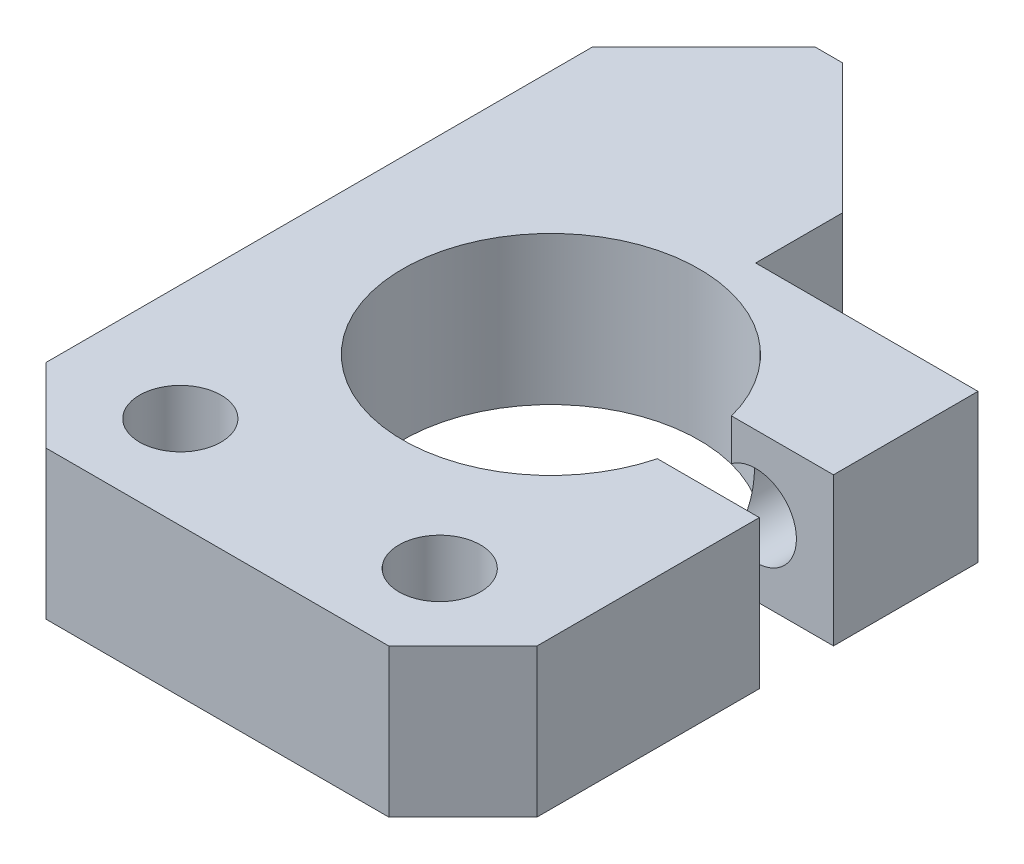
ISO-10303-21;
HEADER;
FILE_DESCRIPTION(('STEP AP214'),'2;1');
FILE_NAME('part.step','',(''),(''),'','','');
FILE_SCHEMA(('AUTOMOTIVE_DESIGN { 1 0 10303 214 1 1 1 1 }'));
ENDSEC;
DATA;
#1=APPLICATION_CONTEXT('core data for automotive mechanical design processes');
#2=APPLICATION_PROTOCOL_DEFINITION('international standard','automotive_design',2000,#1);
#3=PRODUCT_CONTEXT('',#1,'mechanical');
#4=PRODUCT('Part','Part','',(#3));
#5=PRODUCT_RELATED_PRODUCT_CATEGORY('part','',(#4));
#6=PRODUCT_DEFINITION_FORMATION('','',#4);
#7=PRODUCT_DEFINITION_CONTEXT('part definition',#1,'design');
#8=PRODUCT_DEFINITION('design','',#6,#7);
#9=PRODUCT_DEFINITION_SHAPE('','',#8);
#10=(LENGTH_UNIT() NAMED_UNIT(*) SI_UNIT(.MILLI.,.METRE.));
#11=(NAMED_UNIT(*) PLANE_ANGLE_UNIT() SI_UNIT($,.RADIAN.));
#12=(NAMED_UNIT(*) SI_UNIT($,.STERADIAN.) SOLID_ANGLE_UNIT());
#13=UNCERTAINTY_MEASURE_WITH_UNIT(LENGTH_MEASURE(1.E-05),#10,'distance_accuracy_value','');
#14=(GEOMETRIC_REPRESENTATION_CONTEXT(3) GLOBAL_UNCERTAINTY_ASSIGNED_CONTEXT((#13)) GLOBAL_UNIT_ASSIGNED_CONTEXT((#10,
#11,#12)) REPRESENTATION_CONTEXT('',''));
#15=CARTESIAN_POINT('',(0.,0.,0.));
#16=DIRECTION('',(0.,0.,1.));
#17=DIRECTION('',(1.,0.,0.));
#18=AXIS2_PLACEMENT_3D('',#15,#16,#17);
#19=CARTESIAN_POINT('',(0.,4.,0.));
#20=DIRECTION('',(0.,1.,0.));
#21=DIRECTION('',(0.,0.,1.));
#22=AXIS2_PLACEMENT_3D('',#19,#20,#21);
#23=PLANE('',#22);
#24=CARTESIAN_POINT('',(-3.5,4.,6.5));
#25=DIRECTION('',(0.,1.,0.));
#26=DIRECTION('',(0.,0.,1.));
#27=AXIS2_PLACEMENT_3D('',#24,#25,#26);
#28=CIRCLE('',#27,1.1);
#29=CARTESIAN_POINT('',(-3.5,4.,7.6));
#30=VERTEX_POINT('',#29);
#31=EDGE_CURVE('E310',#30,#30,#28,.T.);
#32=ORIENTED_EDGE('',*,*,#31,.F.);
#33=EDGE_LOOP('',(#32));
#34=FACE_BOUND('',#33,.T.);
#35=DIRECTION('',(-1.,0.,0.));
#36=VECTOR('',#35,1.);
#37=CARTESIAN_POINT('',(0.625000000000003,4.,-4.9));
#38=LINE('',#37,#36);
#39=CARTESIAN_POINT('',(6.625,4.,-4.9));
#40=VERTEX_POINT('',#39);
#41=CARTESIAN_POINT('',(0.625000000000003,4.,-4.9));
#42=VERTEX_POINT('',#41);
#43=EDGE_CURVE('E359',#40,#42,#38,.T.);
#44=ORIENTED_EDGE('',*,*,#43,.T.);
#45=DIRECTION('',(0.,0.,-1.));
#46=VECTOR('',#45,1.);
#47=CARTESIAN_POINT('',(0.625000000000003,4.,-7.25));
#48=LINE('',#47,#46);
#49=CARTESIAN_POINT('',(0.625000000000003,4.,-7.25));
#50=VERTEX_POINT('',#49);
#51=EDGE_CURVE('E299',#42,#50,#48,.T.);
#52=ORIENTED_EDGE('',*,*,#51,.T.);
#53=DIRECTION('',(-0.707106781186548,0.,-0.707106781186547));
#54=VECTOR('',#53,1.);
#55=CARTESIAN_POINT('',(-2.875,4.,-10.75));
#56=LINE('',#55,#54);
#57=CARTESIAN_POINT('',(-2.875,4.,-10.75));
#58=VERTEX_POINT('',#57);
#59=EDGE_CURVE('E395',#50,#58,#56,.T.);
#60=ORIENTED_EDGE('',*,*,#59,.T.);
#61=DIRECTION('',(-1.,0.,0.));
#62=VECTOR('',#61,1.);
#63=CARTESIAN_POINT('',(-3.625,4.,-10.75));
#64=LINE('',#63,#62);
#65=CARTESIAN_POINT('',(-3.625,4.,-10.75));
#66=VERTEX_POINT('',#65);
#67=EDGE_CURVE('E392',#58,#66,#64,.T.);
#68=ORIENTED_EDGE('',*,*,#67,.T.);
#69=DIRECTION('',(-0.707106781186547,0.,0.707106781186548));
#70=VECTOR('',#69,1.);
#71=CARTESIAN_POINT('',(-6.625,4.,-7.75));
#72=LINE('',#71,#70);
#73=CARTESIAN_POINT('',(-6.625,4.,-7.75));
#74=VERTEX_POINT('',#73);
#75=EDGE_CURVE('E389',#66,#74,#72,.T.);
#76=ORIENTED_EDGE('',*,*,#75,.T.);
#77=DIRECTION('',(0.,0.,1.));
#78=VECTOR('',#77,1.);
#79=CARTESIAN_POINT('',(-6.625,4.,7.));
#80=LINE('',#79,#78);
#81=CARTESIAN_POINT('',(-6.625,4.,7.));
#82=VERTEX_POINT('',#81);
#83=EDGE_CURVE('E386',#74,#82,#80,.T.);
#84=ORIENTED_EDGE('',*,*,#83,.T.);
#85=DIRECTION('',(0.707106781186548,0.,0.707106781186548));
#86=VECTOR('',#85,1.);
#87=CARTESIAN_POINT('',(-4.625,4.,9.));
#88=LINE('',#87,#86);
#89=CARTESIAN_POINT('',(-4.625,4.,9.));
#90=VERTEX_POINT('',#89);
#91=EDGE_CURVE('E383',#82,#90,#88,.T.);
#92=ORIENTED_EDGE('',*,*,#91,.T.);
#93=DIRECTION('',(1.,0.,0.));
#94=VECTOR('',#93,1.);
#95=CARTESIAN_POINT('',(4.625,4.,9.));
#96=LINE('',#95,#94);
#97=CARTESIAN_POINT('',(4.625,4.,9.));
#98=VERTEX_POINT('',#97);
#99=EDGE_CURVE('E380',#90,#98,#96,.T.);
#100=ORIENTED_EDGE('',*,*,#99,.T.);
#101=DIRECTION('',(0.707106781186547,0.,-0.707106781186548));
#102=VECTOR('',#101,1.);
#103=CARTESIAN_POINT('',(6.625,4.,7.));
#104=LINE('',#103,#102);
#105=CARTESIAN_POINT('',(6.625,4.,7.));
#106=VERTEX_POINT('',#105);
#107=EDGE_CURVE('E377',#98,#106,#104,.T.);
#108=ORIENTED_EDGE('',*,*,#107,.T.);
#109=DIRECTION('',(0.,0.,-1.));
#110=VECTOR('',#109,1.);
#111=CARTESIAN_POINT('',(6.625,4.,7.));
#112=LINE('',#111,#110);
#113=CARTESIAN_POINT('',(6.625,4.,0.999999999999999));
#114=VERTEX_POINT('',#113);
#115=EDGE_CURVE('E374',#106,#114,#112,.T.);
#116=ORIENTED_EDGE('',*,*,#115,.T.);
#117=DIRECTION('',(-1.,0.,0.));
#118=VECTOR('',#117,1.);
#119=CARTESIAN_POINT('',(6.625,4.,0.999999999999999));
#120=LINE('',#119,#118);
#121=CARTESIAN_POINT('',(3.87298334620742,4.,1.));
#122=VERTEX_POINT('',#121);
#123=EDGE_CURVE('E369',#114,#122,#120,.T.);
#124=ORIENTED_EDGE('',*,*,#123,.T.);
#125=CARTESIAN_POINT('',(0.,4.,0.));
#126=DIRECTION('',(0.,-1.,0.));
#127=DIRECTION('',(0.,0.,1.));
#128=AXIS2_PLACEMENT_3D('',#125,#126,#127);
#129=CIRCLE('',#128,4.);
#130=CARTESIAN_POINT('',(3.87298334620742,4.,-1.));
#131=VERTEX_POINT('',#130);
#132=EDGE_CURVE('E367',#122,#131,#129,.T.);
#133=ORIENTED_EDGE('',*,*,#132,.T.);
#134=DIRECTION('',(1.,0.,0.));
#135=VECTOR('',#134,1.);
#136=CARTESIAN_POINT('',(6.625,4.,-1.));
#137=LINE('',#136,#135);
#138=CARTESIAN_POINT('',(6.625,4.,-1.));
#139=VERTEX_POINT('',#138);
#140=EDGE_CURVE('E237',#131,#139,#137,.T.);
#141=ORIENTED_EDGE('',*,*,#140,.T.);
#142=DIRECTION('',(0.,0.,-1.));
#143=VECTOR('',#142,1.);
#144=CARTESIAN_POINT('',(6.625,4.,-4.9));
#145=LINE('',#144,#143);
#146=EDGE_CURVE('E320',#139,#40,#145,.T.);
#147=ORIENTED_EDGE('',*,*,#146,.T.);
#148=EDGE_LOOP('',(#44,#52,#60,#68,#76,#84,#92,#100,#108,#116,#124,#133,#141,#147));
#149=FACE_BOUND('',#148,.T.);
#150=CARTESIAN_POINT('',(3.5,4.,6.5));
#151=DIRECTION('',(0.,1.,0.));
#152=DIRECTION('',(0.,0.,1.));
#153=AXIS2_PLACEMENT_3D('',#150,#151,#152);
#154=CIRCLE('',#153,1.1);
#155=CARTESIAN_POINT('',(3.5,4.,7.6));
#156=VERTEX_POINT('',#155);
#157=EDGE_CURVE('E194',#156,#156,#154,.T.);
#158=ORIENTED_EDGE('',*,*,#157,.F.);
#159=EDGE_LOOP('',(#158));
#160=FACE_BOUND('',#159,.T.);
#161=ADVANCED_FACE('F48',(#34,#149,#160),#23,.T.);
#162=CARTESIAN_POINT('',(0.,0.,0.));
#163=DIRECTION('',(0.,1.,0.));
#164=DIRECTION('',(0.,0.,1.));
#165=AXIS2_PLACEMENT_3D('',#162,#163,#164);
#166=PLANE('',#165);
#167=DIRECTION('',(-1.,0.,0.));
#168=VECTOR('',#167,1.);
#169=CARTESIAN_POINT('',(0.625000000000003,0.,-4.9));
#170=LINE('',#169,#168);
#171=CARTESIAN_POINT('',(6.625,0.,-4.9));
#172=VERTEX_POINT('',#171);
#173=CARTESIAN_POINT('',(0.625000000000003,0.,-4.9));
#174=VERTEX_POINT('',#173);
#175=EDGE_CURVE('E305',#172,#174,#170,.T.);
#176=ORIENTED_EDGE('',*,*,#175,.F.);
#177=DIRECTION('',(0.,0.,-1.));
#178=VECTOR('',#177,1.);
#179=CARTESIAN_POINT('',(6.625,0.,-4.9));
#180=LINE('',#179,#178);
#181=CARTESIAN_POINT('',(6.625,0.,-1.));
#182=VERTEX_POINT('',#181);
#183=EDGE_CURVE('E357',#182,#172,#180,.T.);
#184=ORIENTED_EDGE('',*,*,#183,.F.);
#185=DIRECTION('',(1.,0.,0.));
#186=VECTOR('',#185,1.);
#187=CARTESIAN_POINT('',(6.625,0.,-1.));
#188=LINE('',#187,#186);
#189=CARTESIAN_POINT('',(3.87298334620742,0.,-1.));
#190=VERTEX_POINT('',#189);
#191=EDGE_CURVE('E354',#190,#182,#188,.T.);
#192=ORIENTED_EDGE('',*,*,#191,.F.);
#193=CARTESIAN_POINT('',(0.,0.,0.));
#194=DIRECTION('',(0.,-1.,0.));
#195=DIRECTION('',(0.,0.,1.));
#196=AXIS2_PLACEMENT_3D('',#193,#194,#195);
#197=CIRCLE('',#196,4.);
#198=CARTESIAN_POINT('',(3.87298334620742,0.,1.));
#199=VERTEX_POINT('',#198);
#200=EDGE_CURVE('E350',#199,#190,#197,.T.);
#201=ORIENTED_EDGE('',*,*,#200,.F.);
#202=DIRECTION('',(-1.,0.,0.));
#203=VECTOR('',#202,1.);
#204=CARTESIAN_POINT('',(6.625,0.,0.999999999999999));
#205=LINE('',#204,#203);
#206=CARTESIAN_POINT('',(6.625,0.,0.999999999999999));
#207=VERTEX_POINT('',#206);
#208=EDGE_CURVE('E346',#207,#199,#205,.T.);
#209=ORIENTED_EDGE('',*,*,#208,.F.);
#210=DIRECTION('',(0.,0.,-1.));
#211=VECTOR('',#210,1.);
#212=CARTESIAN_POINT('',(6.625,0.,7.));
#213=LINE('',#212,#211);
#214=CARTESIAN_POINT('',(6.625,0.,7.));
#215=VERTEX_POINT('',#214);
#216=EDGE_CURVE('E343',#215,#207,#213,.T.);
#217=ORIENTED_EDGE('',*,*,#216,.F.);
#218=DIRECTION('',(0.707106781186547,0.,-0.707106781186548));
#219=VECTOR('',#218,1.);
#220=CARTESIAN_POINT('',(6.625,0.,7.));
#221=LINE('',#220,#219);
#222=CARTESIAN_POINT('',(4.625,0.,9.));
#223=VERTEX_POINT('',#222);
#224=EDGE_CURVE('E340',#223,#215,#221,.T.);
#225=ORIENTED_EDGE('',*,*,#224,.F.);
#226=DIRECTION('',(1.,0.,0.));
#227=VECTOR('',#226,1.);
#228=CARTESIAN_POINT('',(4.625,0.,9.));
#229=LINE('',#228,#227);
#230=CARTESIAN_POINT('',(-4.625,0.,9.));
#231=VERTEX_POINT('',#230);
#232=EDGE_CURVE('E337',#231,#223,#229,.T.);
#233=ORIENTED_EDGE('',*,*,#232,.F.);
#234=DIRECTION('',(0.707106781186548,0.,0.707106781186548));
#235=VECTOR('',#234,1.);
#236=CARTESIAN_POINT('',(-4.625,0.,9.));
#237=LINE('',#236,#235);
#238=CARTESIAN_POINT('',(-6.625,0.,7.));
#239=VERTEX_POINT('',#238);
#240=EDGE_CURVE('E334',#239,#231,#237,.T.);
#241=ORIENTED_EDGE('',*,*,#240,.F.);
#242=DIRECTION('',(0.,0.,1.));
#243=VECTOR('',#242,1.);
#244=CARTESIAN_POINT('',(-6.625,0.,7.));
#245=LINE('',#244,#243);
#246=CARTESIAN_POINT('',(-6.625,0.,-7.75));
#247=VERTEX_POINT('',#246);
#248=EDGE_CURVE('E331',#247,#239,#245,.T.);
#249=ORIENTED_EDGE('',*,*,#248,.F.);
#250=DIRECTION('',(-0.707106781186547,0.,0.707106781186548));
#251=VECTOR('',#250,1.);
#252=CARTESIAN_POINT('',(-6.625,0.,-7.75));
#253=LINE('',#252,#251);
#254=CARTESIAN_POINT('',(-3.625,0.,-10.75));
#255=VERTEX_POINT('',#254);
#256=EDGE_CURVE('E328',#255,#247,#253,.T.);
#257=ORIENTED_EDGE('',*,*,#256,.F.);
#258=DIRECTION('',(-1.,0.,0.));
#259=VECTOR('',#258,1.);
#260=CARTESIAN_POINT('',(-3.625,0.,-10.75));
#261=LINE('',#260,#259);
#262=CARTESIAN_POINT('',(-2.875,0.,-10.75));
#263=VERTEX_POINT('',#262);
#264=EDGE_CURVE('E325',#263,#255,#261,.T.);
#265=ORIENTED_EDGE('',*,*,#264,.F.);
#266=DIRECTION('',(-0.707106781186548,0.,-0.707106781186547));
#267=VECTOR('',#266,1.);
#268=CARTESIAN_POINT('',(-2.875,0.,-10.75));
#269=LINE('',#268,#267);
#270=CARTESIAN_POINT('',(0.625000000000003,0.,-7.25));
#271=VERTEX_POINT('',#270);
#272=EDGE_CURVE('E314',#271,#263,#269,.T.);
#273=ORIENTED_EDGE('',*,*,#272,.F.);
#274=DIRECTION('',(0.,0.,-1.));
#275=VECTOR('',#274,1.);
#276=CARTESIAN_POINT('',(0.625000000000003,0.,-7.25));
#277=LINE('',#276,#275);
#278=EDGE_CURVE('E298',#174,#271,#277,.T.);
#279=ORIENTED_EDGE('',*,*,#278,.F.);
#280=EDGE_LOOP('',(#176,#184,#192,#201,#209,#217,#225,#233,#241,#249,#257,#265,#273,#279));
#281=FACE_BOUND('',#280,.T.);
#282=CARTESIAN_POINT('',(-3.5,0.,6.5));
#283=DIRECTION('',(0.,1.,0.));
#284=DIRECTION('',(0.,0.,1.));
#285=AXIS2_PLACEMENT_3D('',#282,#283,#284);
#286=CIRCLE('',#285,1.1);
#287=CARTESIAN_POINT('',(-3.5,0.,7.6));
#288=VERTEX_POINT('',#287);
#289=EDGE_CURVE('E317',#288,#288,#286,.T.);
#290=ORIENTED_EDGE('',*,*,#289,.T.);
#291=EDGE_LOOP('',(#290));
#292=FACE_BOUND('',#291,.T.);
#293=CARTESIAN_POINT('',(3.5,0.,6.5));
#294=DIRECTION('',(0.,1.,0.));
#295=DIRECTION('',(0.,0.,1.));
#296=AXIS2_PLACEMENT_3D('',#293,#294,#295);
#297=CIRCLE('',#296,1.1);
#298=CARTESIAN_POINT('',(3.5,0.,7.6));
#299=VERTEX_POINT('',#298);
#300=EDGE_CURVE('E193',#299,#299,#297,.T.);
#301=ORIENTED_EDGE('',*,*,#300,.T.);
#302=EDGE_LOOP('',(#301));
#303=FACE_BOUND('',#302,.T.);
#304=ADVANCED_FACE('F216',(#281,#292,#303),#166,.F.);
#305=CARTESIAN_POINT('',(0.625000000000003,4.,-4.9));
#306=DIRECTION('',(0.,0.,1.));
#307=DIRECTION('',(1.,0.,0.));
#308=AXIS2_PLACEMENT_3D('',#305,#306,#307);
#309=PLANE('',#308);
#310=CARTESIAN_POINT('',(4.525,2.,-4.9));
#311=DIRECTION('',(0.,0.,-1.));
#312=DIRECTION('',(-1.,0.,0.));
#313=AXIS2_PLACEMENT_3D('',#310,#311,#312);
#314=CIRCLE('',#313,1.1);
#315=CARTESIAN_POINT('',(3.425,2.,-4.9));
#316=VERTEX_POINT('',#315);
#317=EDGE_CURVE('E178',#316,#316,#314,.T.);
#318=ORIENTED_EDGE('',*,*,#317,.F.);
#319=EDGE_LOOP('',(#318));
#320=FACE_BOUND('',#319,.T.);
#321=ORIENTED_EDGE('',*,*,#175,.T.);
#322=DIRECTION('',(0.,-1.,0.));
#323=VECTOR('',#322,1.);
#324=CARTESIAN_POINT('',(0.625000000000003,4.,-4.9));
#325=LINE('',#324,#323);
#326=EDGE_CURVE('E289',#42,#174,#325,.T.);
#327=ORIENTED_EDGE('',*,*,#326,.F.);
#328=ORIENTED_EDGE('',*,*,#43,.F.);
#329=DIRECTION('',(0.,-1.,0.));
#330=VECTOR('',#329,1.);
#331=CARTESIAN_POINT('',(6.625,4.,-4.9));
#332=LINE('',#331,#330);
#333=EDGE_CURVE('E307',#40,#172,#332,.T.);
#334=ORIENTED_EDGE('',*,*,#333,.T.);
#335=EDGE_LOOP('',(#321,#327,#328,#334));
#336=FACE_BOUND('',#335,.T.);
#337=ADVANCED_FACE('F50',(#320,#336),#309,.F.);
#338=CARTESIAN_POINT('',(0.625000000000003,4.,-7.25));
#339=DIRECTION('',(-1.,0.,0.));
#340=DIRECTION('',(0.,0.,1.));
#341=AXIS2_PLACEMENT_3D('',#338,#339,#340);
#342=PLANE('',#341);
#343=ORIENTED_EDGE('',*,*,#278,.T.);
#344=DIRECTION('',(0.,-1.,0.));
#345=VECTOR('',#344,1.);
#346=CARTESIAN_POINT('',(0.625000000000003,4.,-7.25));
#347=LINE('',#346,#345);
#348=EDGE_CURVE('E285',#50,#271,#347,.T.);
#349=ORIENTED_EDGE('',*,*,#348,.F.);
#350=ORIENTED_EDGE('',*,*,#51,.F.);
#351=ORIENTED_EDGE('',*,*,#326,.T.);
#352=EDGE_LOOP('',(#343,#349,#350,#351));
#353=FACE_BOUND('',#352,.T.);
#354=ADVANCED_FACE('F296',(#353),#342,.F.);
#355=CARTESIAN_POINT('',(-2.875,4.,-10.75));
#356=DIRECTION('',(-0.707106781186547,0.,0.707106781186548));
#357=DIRECTION('',(0.707106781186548,0.,0.707106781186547));
#358=AXIS2_PLACEMENT_3D('',#355,#356,#357);
#359=PLANE('',#358);
#360=ORIENTED_EDGE('',*,*,#272,.T.);
#361=DIRECTION('',(0.,-1.,0.));
#362=VECTOR('',#361,1.);
#363=CARTESIAN_POINT('',(-2.875,4.,-10.75));
#364=LINE('',#363,#362);
#365=EDGE_CURVE('E281',#58,#263,#364,.T.);
#366=ORIENTED_EDGE('',*,*,#365,.F.);
#367=ORIENTED_EDGE('',*,*,#59,.F.);
#368=ORIENTED_EDGE('',*,*,#348,.T.);
#369=EDGE_LOOP('',(#360,#366,#367,#368));
#370=FACE_BOUND('',#369,.T.);
#371=ADVANCED_FACE('F420',(#370),#359,.F.);
#372=CARTESIAN_POINT('',(-3.625,4.,-10.75));
#373=DIRECTION('',(0.,0.,1.));
#374=DIRECTION('',(1.,0.,0.));
#375=AXIS2_PLACEMENT_3D('',#372,#373,#374);
#376=PLANE('',#375);
#377=ORIENTED_EDGE('',*,*,#264,.T.);
#378=DIRECTION('',(0.,-1.,0.));
#379=VECTOR('',#378,1.);
#380=CARTESIAN_POINT('',(-3.625,4.,-10.75));
#381=LINE('',#380,#379);
#382=EDGE_CURVE('E277',#66,#255,#381,.T.);
#383=ORIENTED_EDGE('',*,*,#382,.F.);
#384=ORIENTED_EDGE('',*,*,#67,.F.);
#385=ORIENTED_EDGE('',*,*,#365,.T.);
#386=EDGE_LOOP('',(#377,#383,#384,#385));
#387=FACE_BOUND('',#386,.T.);
#388=ADVANCED_FACE('F425',(#387),#376,.F.);
#389=CARTESIAN_POINT('',(-6.625,4.,-7.75));
#390=DIRECTION('',(0.707106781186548,0.,0.707106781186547));
#391=DIRECTION('',(0.707106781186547,0.,-0.707106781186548));
#392=AXIS2_PLACEMENT_3D('',#389,#390,#391);
#393=PLANE('',#392);
#394=ORIENTED_EDGE('',*,*,#256,.T.);
#395=DIRECTION('',(0.,-1.,0.));
#396=VECTOR('',#395,1.);
#397=CARTESIAN_POINT('',(-6.625,4.,-7.75));
#398=LINE('',#397,#396);
#399=EDGE_CURVE('E273',#74,#247,#398,.T.);
#400=ORIENTED_EDGE('',*,*,#399,.F.);
#401=ORIENTED_EDGE('',*,*,#75,.F.);
#402=ORIENTED_EDGE('',*,*,#382,.T.);
#403=EDGE_LOOP('',(#394,#400,#401,#402));
#404=FACE_BOUND('',#403,.T.);
#405=ADVANCED_FACE('F431',(#404),#393,.F.);
#406=CARTESIAN_POINT('',(-6.625,4.,7.));
#407=DIRECTION('',(1.,0.,0.));
#408=DIRECTION('',(0.,0.,-1.));
#409=AXIS2_PLACEMENT_3D('',#406,#407,#408);
#410=PLANE('',#409);
#411=ORIENTED_EDGE('',*,*,#248,.T.);
#412=DIRECTION('',(0.,-1.,0.));
#413=VECTOR('',#412,1.);
#414=CARTESIAN_POINT('',(-6.625,4.,7.));
#415=LINE('',#414,#413);
#416=EDGE_CURVE('E269',#82,#239,#415,.T.);
#417=ORIENTED_EDGE('',*,*,#416,.F.);
#418=ORIENTED_EDGE('',*,*,#83,.F.);
#419=ORIENTED_EDGE('',*,*,#399,.T.);
#420=EDGE_LOOP('',(#411,#417,#418,#419));
#421=FACE_BOUND('',#420,.T.);
#422=ADVANCED_FACE('F435',(#421),#410,.F.);
#423=CARTESIAN_POINT('',(-4.625,4.,9.));
#424=DIRECTION('',(0.707106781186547,0.,-0.707106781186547));
#425=DIRECTION('',(-0.707106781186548,0.,-0.707106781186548));
#426=AXIS2_PLACEMENT_3D('',#423,#424,#425);
#427=PLANE('',#426);
#428=ORIENTED_EDGE('',*,*,#240,.T.);
#429=DIRECTION('',(0.,-1.,0.));
#430=VECTOR('',#429,1.);
#431=CARTESIAN_POINT('',(-4.625,4.,9.));
#432=LINE('',#431,#430);
#433=EDGE_CURVE('E265',#90,#231,#432,.T.);
#434=ORIENTED_EDGE('',*,*,#433,.F.);
#435=ORIENTED_EDGE('',*,*,#91,.F.);
#436=ORIENTED_EDGE('',*,*,#416,.T.);
#437=EDGE_LOOP('',(#428,#434,#435,#436));
#438=FACE_BOUND('',#437,.T.);
#439=ADVANCED_FACE('F440',(#438),#427,.F.);
#440=CARTESIAN_POINT('',(4.625,4.,9.));
#441=DIRECTION('',(0.,0.,-1.));
#442=DIRECTION('',(-1.,0.,0.));
#443=AXIS2_PLACEMENT_3D('',#440,#441,#442);
#444=PLANE('',#443);
#445=ORIENTED_EDGE('',*,*,#232,.T.);
#446=DIRECTION('',(0.,-1.,0.));
#447=VECTOR('',#446,1.);
#448=CARTESIAN_POINT('',(4.625,4.,9.));
#449=LINE('',#448,#447);
#450=EDGE_CURVE('E261',#98,#223,#449,.T.);
#451=ORIENTED_EDGE('',*,*,#450,.F.);
#452=ORIENTED_EDGE('',*,*,#99,.F.);
#453=ORIENTED_EDGE('',*,*,#433,.T.);
#454=EDGE_LOOP('',(#445,#451,#452,#453));
#455=FACE_BOUND('',#454,.T.);
#456=ADVANCED_FACE('F446',(#455),#444,.F.);
#457=CARTESIAN_POINT('',(6.625,4.,7.));
#458=DIRECTION('',(-0.707106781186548,0.,-0.707106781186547));
#459=DIRECTION('',(-0.707106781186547,0.,0.707106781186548));
#460=AXIS2_PLACEMENT_3D('',#457,#458,#459);
#461=PLANE('',#460);
#462=ORIENTED_EDGE('',*,*,#224,.T.);
#463=DIRECTION('',(0.,-1.,0.));
#464=VECTOR('',#463,1.);
#465=CARTESIAN_POINT('',(6.625,4.,7.));
#466=LINE('',#465,#464);
#467=EDGE_CURVE('E257',#106,#215,#466,.T.);
#468=ORIENTED_EDGE('',*,*,#467,.F.);
#469=ORIENTED_EDGE('',*,*,#107,.F.);
#470=ORIENTED_EDGE('',*,*,#450,.T.);
#471=EDGE_LOOP('',(#462,#468,#469,#470));
#472=FACE_BOUND('',#471,.T.);
#473=ADVANCED_FACE('F450',(#472),#461,.F.);
#474=CARTESIAN_POINT('',(6.625,4.,7.));
#475=DIRECTION('',(-1.,0.,0.));
#476=DIRECTION('',(0.,0.,1.));
#477=AXIS2_PLACEMENT_3D('',#474,#475,#476);
#478=PLANE('',#477);
#479=ORIENTED_EDGE('',*,*,#216,.T.);
#480=DIRECTION('',(0.,-1.,0.));
#481=VECTOR('',#480,1.);
#482=CARTESIAN_POINT('',(6.625,4.,0.999999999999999));
#483=LINE('',#482,#481);
#484=EDGE_CURVE('E253',#114,#207,#483,.T.);
#485=ORIENTED_EDGE('',*,*,#484,.F.);
#486=ORIENTED_EDGE('',*,*,#115,.F.);
#487=ORIENTED_EDGE('',*,*,#467,.T.);
#488=EDGE_LOOP('',(#479,#485,#486,#487));
#489=FACE_BOUND('',#488,.T.);
#490=ADVANCED_FACE('F455',(#489),#478,.F.);
#491=CARTESIAN_POINT('',(6.625,4.,0.999999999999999));
#492=DIRECTION('',(0.,0.,1.));
#493=DIRECTION('',(1.,0.,0.));
#494=AXIS2_PLACEMENT_3D('',#491,#492,#493);
#495=PLANE('',#494);
#496=DIRECTION('',(0.,-1.,0.));
#497=VECTOR('',#496,1.);
#498=CARTESIAN_POINT('',(3.87298334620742,4.,1.));
#499=LINE('',#498,#497);
#500=CARTESIAN_POINT('',(3.87298334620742,1.53645465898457,1.));
#501=VERTEX_POINT('',#500);
#502=EDGE_CURVE('E240',#501,#199,#499,.T.);
#503=ORIENTED_EDGE('',*,*,#502,.F.);
#504=CARTESIAN_POINT('',(4.525,2.,0.999999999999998));
#505=DIRECTION('',(0.,0.,-1.));
#506=DIRECTION('',(-1.,0.,0.));
#507=AXIS2_PLACEMENT_3D('',#504,#505,#506);
#508=CIRCLE('',#507,0.79999999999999);
#509=CARTESIAN_POINT('',(3.87298334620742,2.46354534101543,0.999999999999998));
#510=VERTEX_POINT('',#509);
#511=EDGE_CURVE('E69',#510,#501,#508,.T.);
#512=ORIENTED_EDGE('',*,*,#511,.F.);
#513=EDGE_CURVE('E245',#122,#510,#499,.T.);
#514=ORIENTED_EDGE('',*,*,#513,.F.);
#515=ORIENTED_EDGE('',*,*,#123,.F.);
#516=ORIENTED_EDGE('',*,*,#484,.T.);
#517=ORIENTED_EDGE('',*,*,#208,.T.);
#518=EDGE_LOOP('',(#503,#512,#514,#515,#516,#517));
#519=FACE_BOUND('',#518,.T.);
#520=ADVANCED_FACE('F229',(#519),#495,.F.);
#521=CARTESIAN_POINT('',(0.,4.,0.));
#522=DIRECTION('',(0.,-1.,0.));
#523=DIRECTION('',(0.,0.,-1.));
#524=AXIS2_PLACEMENT_3D('',#521,#522,#523);
#525=CYLINDRICAL_SURFACE('',#524,4.);
#526=ORIENTED_EDGE('',*,*,#513,.T.);
#527=CARTESIAN_POINT('',(3.87298334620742,2.46354534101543,1.));
#528=CARTESIAN_POINT('',(3.86679880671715,2.45483203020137,1.0239622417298));
#529=CARTESIAN_POINT('',(3.86043528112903,2.44552496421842,1.04767992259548));
#530=CARTESIAN_POINT('',(3.84741457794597,2.42547046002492,1.0945270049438));
#531=CARTESIAN_POINT('',(3.84075636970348,2.41471764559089,1.11765380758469));
#532=CARTESIAN_POINT('',(3.8271462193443,2.39138828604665,1.16341394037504));
#533=CARTESIAN_POINT('',(3.82019122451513,2.37878419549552,1.18603250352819));
#534=CARTESIAN_POINT('',(3.80625597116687,2.35162487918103,1.23001865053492));
#535=CARTESIAN_POINT('',(3.79927577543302,2.33707299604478,1.25138828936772));
#536=CARTESIAN_POINT('',(3.78589047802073,2.30655968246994,1.29129816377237));
#537=CARTESIAN_POINT('',(3.7794751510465,2.29072412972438,1.30993001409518));
#538=CARTESIAN_POINT('',(3.7671091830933,2.25676225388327,1.34507749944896));
#539=CARTESIAN_POINT('',(3.76115710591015,2.23864350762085,1.36159978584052));
#540=CARTESIAN_POINT('',(3.7509143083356,2.20270037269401,1.38954330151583));
#541=CARTESIAN_POINT('',(3.74650789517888,2.1852186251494,1.40135706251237));
#542=CARTESIAN_POINT('',(3.73866580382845,2.1484258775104,1.42214691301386));
#543=CARTESIAN_POINT('',(3.7352288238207,2.12911737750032,1.43112680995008));
#544=CARTESIAN_POINT('',(3.73027615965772,2.09312761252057,1.44397972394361));
#545=CARTESIAN_POINT('',(3.72851077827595,2.07672201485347,1.44852302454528));
#546=CARTESIAN_POINT('',(3.7259989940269,2.04332353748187,1.45497212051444));
#547=CARTESIAN_POINT('',(3.72525182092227,2.02633111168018,1.45687990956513));
#548=CARTESIAN_POINT('',(3.72485564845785,1.99221320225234,1.45789258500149));
#549=CARTESIAN_POINT('',(3.72520893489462,1.97508751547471,1.45699163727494));
#550=CARTESIAN_POINT('',(3.72697941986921,1.94125875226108,1.45245654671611));
#551=CARTESIAN_POINT('',(3.72839713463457,1.92455588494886,1.4488210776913));
#552=CARTESIAN_POINT('',(3.73212170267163,1.89227836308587,1.43919878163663));
#553=CARTESIAN_POINT('',(3.73441284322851,1.87668924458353,1.43325347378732));
#554=CARTESIAN_POINT('',(3.73970409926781,1.84655709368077,1.41939020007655));
#555=CARTESIAN_POINT('',(3.74270442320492,1.83201437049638,1.41147165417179));
#556=CARTESIAN_POINT('',(3.75140240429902,1.79477251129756,1.38824235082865));
#557=CARTESIAN_POINT('',(3.75756843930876,1.77306779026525,1.37151398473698));
#558=CARTESIAN_POINT('',(3.77069342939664,1.73265185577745,1.33501021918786));
#559=CARTESIAN_POINT('',(3.77765505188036,1.71395125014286,1.31522448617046));
#560=CARTESIAN_POINT('',(3.7971055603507,1.66648125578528,1.25834268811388));
#561=CARTESIAN_POINT('',(3.80991233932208,1.640353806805,1.21917178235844));
#562=CARTESIAN_POINT('',(3.8351126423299,1.59411030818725,1.1374344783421));
#563=CARTESIAN_POINT('',(3.84750565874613,1.57400141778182,1.0948641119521));
#564=CARTESIAN_POINT('',(3.86400386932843,1.54928129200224,1.03430594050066));
#565=CARTESIAN_POINT('',(3.86854044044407,1.54271588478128,1.01721424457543));
#566=CARTESIAN_POINT('',(3.87298334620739,1.53645465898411,1.00000000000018));
#567=B_SPLINE_CURVE_WITH_KNOTS('',3,(#527,#528,#529,#530,#531,#532,#533,#534,#535,#536,#537,
#538,#539,#540,#541,#542,#543,#544,#545,#546,#547,#548,#549,#550,#551,#552,#553,#554,#555,#556,
#557,#558,#559,#560,#561,#562,#563,#564,#565,#566),.UNSPECIFIED.,.F.,.F.,(4,2,2,2,2,2,2,2,2,2,2,
2,2,2,2,2,2,2,2,4),(0.,0.0787253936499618,0.157752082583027,0.238103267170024,0.318318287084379,
0.394006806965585,0.469450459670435,0.5338884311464,0.598239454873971,0.64936438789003,
0.700450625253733,0.751643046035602,0.802860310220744,0.853196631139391,0.903547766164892,
0.987325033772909,1.07139191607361,1.21695715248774,1.36269486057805,1.41926142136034),.UNSPECIFIED.);
#568=EDGE_CURVE('E11',#510,#501,#567,.T.);
#569=ORIENTED_EDGE('',*,*,#568,.T.);
#570=ORIENTED_EDGE('',*,*,#502,.T.);
#571=ORIENTED_EDGE('',*,*,#200,.T.);
#572=DIRECTION('',(0.,-1.,0.));
#573=VECTOR('',#572,1.);
#574=CARTESIAN_POINT('',(3.87298334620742,4.,-1.));
#575=LINE('',#574,#573);
#576=CARTESIAN_POINT('',(3.87298334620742,1.11406869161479,-1.));
#577=VERTEX_POINT('',#576);
#578=EDGE_CURVE('E241',#577,#190,#575,.T.);
#579=ORIENTED_EDGE('',*,*,#578,.F.);
#580=CARTESIAN_POINT('',(3.87298334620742,1.11406869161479,-1.));
#581=CARTESIAN_POINT('',(3.85788298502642,1.1252324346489,-1.05854880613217));
#582=CARTESIAN_POINT('',(3.84147708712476,1.13785747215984,-1.11654081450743));
#583=CARTESIAN_POINT('',(3.80626862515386,1.16694836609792,-1.23122093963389));
#584=CARTESIAN_POINT('',(3.78745166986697,1.1834378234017,-1.2878985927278));
#585=CARTESIAN_POINT('',(3.74750416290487,1.22136901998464,-1.39993357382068));
#586=CARTESIAN_POINT('',(3.72634038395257,1.24288844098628,-1.45525335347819));
#587=CARTESIAN_POINT('',(3.68264822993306,1.29181922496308,-1.56250870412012));
#588=CARTESIAN_POINT('',(3.66012408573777,1.31921293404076,-1.61445382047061));
#589=CARTESIAN_POINT('',(3.62025560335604,1.37367811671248,-1.70160474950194));
#590=CARTESIAN_POINT('',(3.6029867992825,1.39920087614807,-1.73780470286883));
#591=CARTESIAN_POINT('',(3.56898788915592,1.45492786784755,-1.80659638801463));
#592=CARTESIAN_POINT('',(3.55225662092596,1.48512104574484,-1.83919633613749));
#593=CARTESIAN_POINT('',(3.52007718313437,1.55111723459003,-1.9000675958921));
#594=CARTESIAN_POINT('',(3.50464869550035,1.58698855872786,-1.92827660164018));
#595=CARTESIAN_POINT('',(3.47675189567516,1.66408117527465,-1.97813425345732));
#596=CARTESIAN_POINT('',(3.46427710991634,1.70529045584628,-1.99979727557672));
#597=CARTESIAN_POINT('',(3.44695401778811,1.7791077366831,-2.02946060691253));
#598=CARTESIAN_POINT('',(3.44094044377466,1.81058084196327,-2.03961032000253));
#599=CARTESIAN_POINT('',(3.43163468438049,1.87506119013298,-2.05522925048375));
#600=CARTESIAN_POINT('',(3.42834066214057,1.90806738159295,-2.06070162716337));
#601=CARTESIAN_POINT('',(3.42477980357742,1.97479884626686,-2.06661467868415));
#602=CARTESIAN_POINT('',(3.42452231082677,2.0085260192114,-2.06703982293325));
#603=CARTESIAN_POINT('',(3.42708433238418,2.07553734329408,-2.06278903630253));
#604=CARTESIAN_POINT('',(3.42990422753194,2.10882143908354,-2.05811247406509));
#605=CARTESIAN_POINT('',(3.4381719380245,2.17262138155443,-2.04426855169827));
#606=CARTESIAN_POINT('',(3.44350664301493,2.20319478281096,-2.03529424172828));
#607=CARTESIAN_POINT('',(3.45632956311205,2.26241842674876,-2.01344140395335));
#608=CARTESIAN_POINT('',(3.46381861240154,2.29106791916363,-2.00056136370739));
#609=CARTESIAN_POINT('',(3.48396638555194,2.35765216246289,-1.96533448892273));
#610=CARTESIAN_POINT('',(3.49747498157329,2.3944287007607,-1.94128402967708));
#611=CARTESIAN_POINT('',(3.5265215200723,2.46307339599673,-1.88800744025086));
#612=CARTESIAN_POINT('',(3.54206298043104,2.49493283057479,-1.85877230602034));
#613=CARTESIAN_POINT('',(3.58208696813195,2.56873421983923,-1.78084003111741));
#614=CARTESIAN_POINT('',(3.60715983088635,2.60776963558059,-1.72971302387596));
#615=CARTESIAN_POINT('',(3.65707398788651,2.67715807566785,-1.62154156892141));
#616=CARTESIAN_POINT('',(3.681913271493,2.70746255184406,-1.56446634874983));
#617=CARTESIAN_POINT('',(3.72207111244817,2.75225468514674,-1.46562157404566));
#618=CARTESIAN_POINT('',(3.73786366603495,2.76868389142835,-1.42489502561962));
#619=CARTESIAN_POINT('',(3.76841197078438,2.79877108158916,-1.34202132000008));
#620=CARTESIAN_POINT('',(3.78316701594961,2.81242719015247,-1.2998732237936));
#621=CARTESIAN_POINT('',(3.81119937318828,2.83715786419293,-1.21520127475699));
#622=CARTESIAN_POINT('',(3.82449731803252,2.84827188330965,-1.17269557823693));
#623=CARTESIAN_POINT('',(3.84975985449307,2.86850757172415,-1.0869010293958));
#624=CARTESIAN_POINT('',(3.86172663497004,2.87763253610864,-1.04361360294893));
#625=CARTESIAN_POINT('',(3.87298334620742,2.88593130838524,-1.00000000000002));
#626=B_SPLINE_CURVE_WITH_KNOTS('',3,(#580,#581,#582,#583,#584,#585,#586,#587,#588,#589,#590,
#591,#592,#593,#594,#595,#596,#597,#598,#599,#600,#601,#602,#603,#604,#605,#606,#607,#608,#609,
#610,#611,#612,#613,#614,#615,#616,#617,#618,#619,#620,#621,#622,#623,#624,#625),.UNSPECIFIED.,
.F.,.F.,(4,2,2,2,2,2,2,2,2,2,2,2,2,2,2,2,2,2,2,2,2,2,4),(0.,0.184512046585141,0.370181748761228,
0.558934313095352,0.747127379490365,0.889452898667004,1.0314465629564,1.17530051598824,
1.3188362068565,1.4192538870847,1.51960368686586,1.62026218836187,1.72093314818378,
1.81745458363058,1.91401344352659,2.0511547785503,2.18853665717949,2.39450172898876,
2.60159088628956,2.74148285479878,2.88146911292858,3.01910768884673,3.15651648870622),.UNSPECIFIED.);
#627=CARTESIAN_POINT('',(3.87298334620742,2.88593130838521,-1.));
#628=VERTEX_POINT('',#627);
#629=EDGE_CURVE('E75',#577,#628,#626,.T.);
#630=ORIENTED_EDGE('',*,*,#629,.T.);
#631=EDGE_CURVE('E234',#131,#628,#575,.T.);
#632=ORIENTED_EDGE('',*,*,#631,.F.);
#633=ORIENTED_EDGE('',*,*,#132,.F.);
#634=EDGE_LOOP('',(#526,#569,#570,#571,#579,#630,#632,#633));
#635=FACE_BOUND('',#634,.T.);
#636=ADVANCED_FACE('F196',(#635),#525,.F.);
#637=CARTESIAN_POINT('',(6.625,4.,-1.));
#638=DIRECTION('',(0.,0.,-1.));
#639=DIRECTION('',(-1.,0.,0.));
#640=AXIS2_PLACEMENT_3D('',#637,#638,#639);
#641=PLANE('',#640);
#642=ORIENTED_EDGE('',*,*,#631,.T.);
#643=CARTESIAN_POINT('',(4.525,2.,-1.));
#644=DIRECTION('',(0.,0.,-1.));
#645=DIRECTION('',(-1.,0.,0.));
#646=AXIS2_PLACEMENT_3D('',#643,#644,#645);
#647=CIRCLE('',#646,1.1);
#648=EDGE_CURVE('E63',#628,#577,#647,.T.);
#649=ORIENTED_EDGE('',*,*,#648,.T.);
#650=ORIENTED_EDGE('',*,*,#578,.T.);
#651=ORIENTED_EDGE('',*,*,#191,.T.);
#652=DIRECTION('',(0.,-1.,0.));
#653=VECTOR('',#652,1.);
#654=CARTESIAN_POINT('',(6.625,4.,-1.));
#655=LINE('',#654,#653);
#656=EDGE_CURVE('E247',#139,#182,#655,.T.);
#657=ORIENTED_EDGE('',*,*,#656,.F.);
#658=ORIENTED_EDGE('',*,*,#140,.F.);
#659=EDGE_LOOP('',(#642,#649,#650,#651,#657,#658));
#660=FACE_BOUND('',#659,.T.);
#661=ADVANCED_FACE('F222',(#660),#641,.F.);
#662=CARTESIAN_POINT('',(6.625,4.,-4.9));
#663=DIRECTION('',(-1.,0.,0.));
#664=DIRECTION('',(0.,0.,1.));
#665=AXIS2_PLACEMENT_3D('',#662,#663,#664);
#666=PLANE('',#665);
#667=ORIENTED_EDGE('',*,*,#183,.T.);
#668=ORIENTED_EDGE('',*,*,#333,.F.);
#669=ORIENTED_EDGE('',*,*,#146,.F.);
#670=ORIENTED_EDGE('',*,*,#656,.T.);
#671=EDGE_LOOP('',(#667,#668,#669,#670));
#672=FACE_BOUND('',#671,.T.);
#673=ADVANCED_FACE('F212',(#672),#666,.F.);
#674=CARTESIAN_POINT('',(-3.5,4.,6.5));
#675=DIRECTION('',(0.,-1.,0.));
#676=DIRECTION('',(0.,0.,-1.));
#677=AXIS2_PLACEMENT_3D('',#674,#675,#676);
#678=CYLINDRICAL_SURFACE('',#677,1.1);
#679=ORIENTED_EDGE('',*,*,#31,.T.);
#680=EDGE_LOOP('',(#679));
#681=FACE_BOUND('',#680,.T.);
#682=ORIENTED_EDGE('',*,*,#289,.F.);
#683=EDGE_LOOP('',(#682));
#684=FACE_BOUND('',#683,.T.);
#685=ADVANCED_FACE('F208',(#681,#684),#678,.F.);
#686=CARTESIAN_POINT('',(3.5,4.,6.5));
#687=DIRECTION('',(0.,-1.,0.));
#688=DIRECTION('',(0.,0.,-1.));
#689=AXIS2_PLACEMENT_3D('',#686,#687,#688);
#690=CYLINDRICAL_SURFACE('',#689,1.1);
#691=ORIENTED_EDGE('',*,*,#157,.T.);
#692=EDGE_LOOP('',(#691));
#693=FACE_BOUND('',#692,.T.);
#694=ORIENTED_EDGE('',*,*,#300,.F.);
#695=EDGE_LOOP('',(#694));
#696=FACE_BOUND('',#695,.T.);
#697=ADVANCED_FACE('F204',(#693,#696),#690,.F.);
#698=CARTESIAN_POINT('',(4.525,2.,-4.9));
#699=DIRECTION('',(0.,0.,-1.));
#700=DIRECTION('',(-1.,0.,0.));
#701=AXIS2_PLACEMENT_3D('',#698,#699,#700);
#702=CYLINDRICAL_SURFACE('',#701,1.1);
#703=ORIENTED_EDGE('',*,*,#317,.T.);
#704=EDGE_LOOP('',(#703));
#705=FACE_BOUND('',#704,.T.);
#706=ORIENTED_EDGE('',*,*,#648,.F.);
#707=ORIENTED_EDGE('',*,*,#629,.F.);
#708=EDGE_LOOP('',(#706,#707));
#709=FACE_BOUND('',#708,.T.);
#710=ADVANCED_FACE('F200',(#705,#709),#702,.F.);
#711=CARTESIAN_POINT('',(4.525,2.,1.));
#712=DIRECTION('',(0.,0.,-1.));
#713=DIRECTION('',(-1.,0.,0.));
#714=AXIS2_PLACEMENT_3D('',#711,#712,#713);
#715=CYLINDRICAL_SURFACE('',#714,0.799999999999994);
#716=CARTESIAN_POINT('',(4.525,2.,5.));
#717=DIRECTION('',(0.,0.,-1.));
#718=DIRECTION('',(-1.,0.,0.));
#719=AXIS2_PLACEMENT_3D('',#716,#717,#718);
#720=CIRCLE('',#719,0.799999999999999);
#721=CARTESIAN_POINT('',(3.725,2.,5.));
#722=VERTEX_POINT('',#721);
#723=EDGE_CURVE('E175',#722,#722,#720,.T.);
#724=ORIENTED_EDGE('',*,*,#723,.F.);
#725=EDGE_LOOP('',(#724));
#726=FACE_BOUND('',#725,.T.);
#727=ORIENTED_EDGE('',*,*,#511,.T.);
#728=ORIENTED_EDGE('',*,*,#568,.F.);
#729=EDGE_LOOP('',(#727,#728));
#730=FACE_BOUND('',#729,.T.);
#731=ADVANCED_FACE('F171',(#726,#730),#715,.F.);
#732=CARTESIAN_POINT('',(4.525,2.,5.));
#733=DIRECTION('',(0.,0.,-1.));
#734=DIRECTION('',(-1.,0.,0.));
#735=AXIS2_PLACEMENT_3D('',#732,#733,#734);
#736=CONICAL_SURFACE('',#735,0.799999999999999,1.02974425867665);
#737=CARTESIAN_POINT('',(4.525,2.,5.48068849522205));
#738=VERTEX_POINT('',#737);
#739=VERTEX_LOOP('',#738);
#740=FACE_BOUND('',#739,.T.);
#741=ORIENTED_EDGE('',*,*,#723,.T.);
#742=EDGE_LOOP('',(#741));
#743=FACE_BOUND('',#742,.T.);
#744=ADVANCED_FACE('F168',(#740,#743),#736,.F.);
#745=CLOSED_SHELL('',(#161,#304,#337,#354,#371,#388,#405,#422,#439,#456,#473,#490,#520,#636,
#661,#673,#685,#697,#710,#731,#744));
#746=MANIFOLD_SOLID_BREP('B2',#745);
#747=ADVANCED_BREP_SHAPE_REPRESENTATION('',(#18,#746),#14);
#748=SHAPE_DEFINITION_REPRESENTATION(#9,#747);
ENDSEC;
END-ISO-10303-21;
